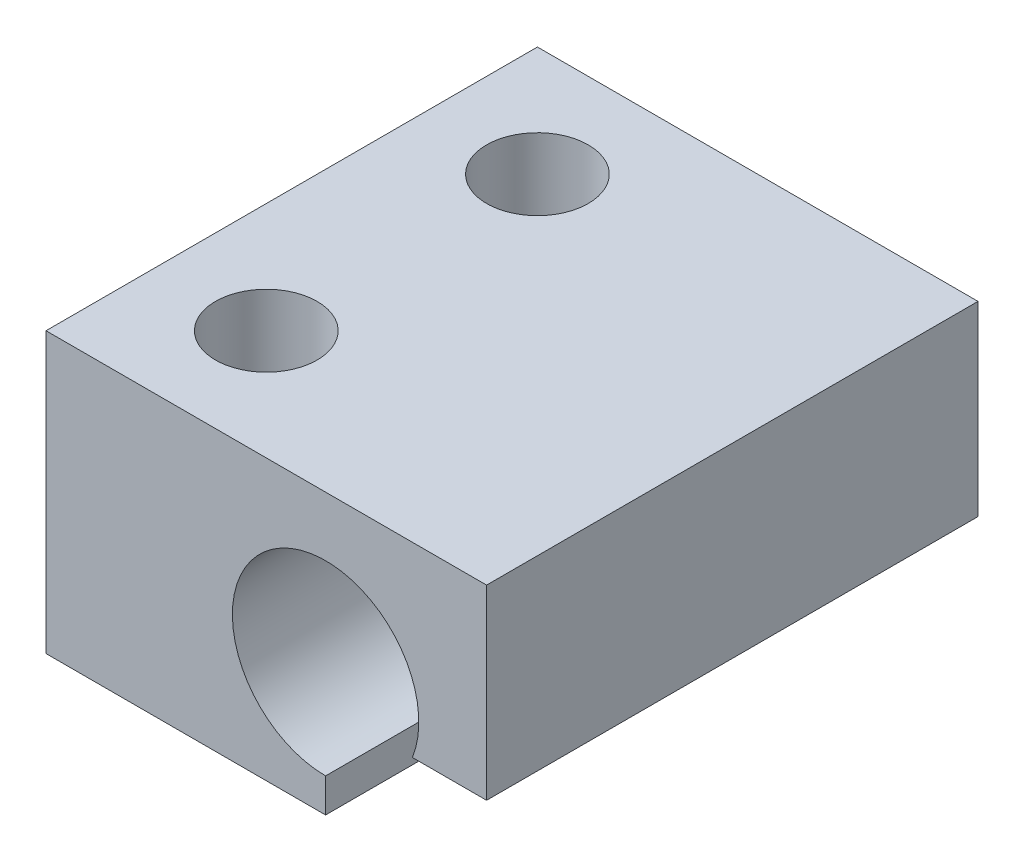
ISO-10303-21;
HEADER;
FILE_DESCRIPTION(('STEP AP214'),'2;1');
FILE_NAME('part.step','',(''),(''),'','','');
FILE_SCHEMA(('AUTOMOTIVE_DESIGN { 1 0 10303 214 1 1 1 1 }'));
ENDSEC;
DATA;
#1=APPLICATION_CONTEXT('core data for automotive mechanical design processes');
#2=APPLICATION_PROTOCOL_DEFINITION('international standard','automotive_design',2000,#1);
#3=PRODUCT_CONTEXT('',#1,'mechanical');
#4=PRODUCT('Part','Part','',(#3));
#5=PRODUCT_RELATED_PRODUCT_CATEGORY('part','',(#4));
#6=PRODUCT_DEFINITION_FORMATION('','',#4);
#7=PRODUCT_DEFINITION_CONTEXT('part definition',#1,'design');
#8=PRODUCT_DEFINITION('design','',#6,#7);
#9=PRODUCT_DEFINITION_SHAPE('','',#8);
#10=(LENGTH_UNIT() NAMED_UNIT(*) SI_UNIT(.MILLI.,.METRE.));
#11=(NAMED_UNIT(*) PLANE_ANGLE_UNIT() SI_UNIT($,.RADIAN.));
#12=(NAMED_UNIT(*) SI_UNIT($,.STERADIAN.) SOLID_ANGLE_UNIT());
#13=UNCERTAINTY_MEASURE_WITH_UNIT(LENGTH_MEASURE(1.E-05),#10,'distance_accuracy_value','');
#14=(GEOMETRIC_REPRESENTATION_CONTEXT(3) GLOBAL_UNCERTAINTY_ASSIGNED_CONTEXT((#13)) GLOBAL_UNIT_ASSIGNED_CONTEXT((#10,
#11,#12)) REPRESENTATION_CONTEXT('',''));
#15=CARTESIAN_POINT('',(0.,0.,0.));
#16=DIRECTION('',(0.,0.,1.));
#17=DIRECTION('',(1.,0.,0.));
#18=AXIS2_PLACEMENT_3D('',#15,#16,#17);
#19=CARTESIAN_POINT('',(-13.,8.25,29.));
#20=DIRECTION('',(1.,0.,0.));
#21=DIRECTION('',(0.,0.,-1.));
#22=AXIS2_PLACEMENT_3D('',#19,#20,#21);
#23=PLANE('',#22);
#24=DIRECTION('',(0.,-1.,0.));
#25=VECTOR('',#24,1.);
#26=CARTESIAN_POINT('',(-13.,8.25,0.));
#27=LINE('',#26,#25);
#28=CARTESIAN_POINT('',(-13.,8.25,0.));
#29=VERTEX_POINT('',#28);
#30=CARTESIAN_POINT('',(-13.,-8.25,0.));
#31=VERTEX_POINT('',#30);
#32=EDGE_CURVE('E120',#29,#31,#27,.T.);
#33=ORIENTED_EDGE('',*,*,#32,.T.);
#34=DIRECTION('',(0.,0.,-1.));
#35=VECTOR('',#34,1.);
#36=CARTESIAN_POINT('',(-13.,-8.25,29.));
#37=LINE('',#36,#35);
#38=CARTESIAN_POINT('',(-13.,-8.25,29.));
#39=VERTEX_POINT('',#38);
#40=EDGE_CURVE('E11',#39,#31,#37,.T.);
#41=ORIENTED_EDGE('',*,*,#40,.F.);
#42=DIRECTION('',(0.,-1.,0.));
#43=VECTOR('',#42,1.);
#44=CARTESIAN_POINT('',(-13.,8.25,29.));
#45=LINE('',#44,#43);
#46=CARTESIAN_POINT('',(-13.,8.25,29.));
#47=VERTEX_POINT('',#46);
#48=EDGE_CURVE('E133',#47,#39,#45,.T.);
#49=ORIENTED_EDGE('',*,*,#48,.F.);
#50=DIRECTION('',(0.,0.,-1.));
#51=VECTOR('',#50,1.);
#52=CARTESIAN_POINT('',(-13.,8.25,29.));
#53=LINE('',#52,#51);
#54=EDGE_CURVE('E116',#47,#29,#53,.T.);
#55=ORIENTED_EDGE('',*,*,#54,.T.);
#56=EDGE_LOOP('',(#33,#41,#49,#55));
#57=FACE_BOUND('',#56,.T.);
#58=ADVANCED_FACE('F30',(#57),#23,.F.);
#59=CARTESIAN_POINT('',(-13.,-8.25,29.));
#60=DIRECTION('',(0.,1.,0.));
#61=DIRECTION('',(0.,0.,1.));
#62=AXIS2_PLACEMENT_3D('',#59,#60,#61);
#63=PLANE('',#62);
#64=CARTESIAN_POINT('',(-6.5,-8.25,22.5));
#65=DIRECTION('',(0.,-1.,0.));
#66=DIRECTION('',(0.,0.,-1.));
#67=AXIS2_PLACEMENT_3D('',#64,#65,#66);
#68=CIRCLE('',#67,4.75);
#69=CARTESIAN_POINT('',(-6.5,-8.25,17.75));
#70=VERTEX_POINT('',#69);
#71=EDGE_CURVE('E176',#70,#70,#68,.T.);
#72=ORIENTED_EDGE('',*,*,#71,.F.);
#73=EDGE_LOOP('',(#72));
#74=FACE_BOUND('',#73,.T.);
#75=CARTESIAN_POINT('',(-6.5,-8.25,6.5));
#76=DIRECTION('',(0.,-1.,0.));
#77=DIRECTION('',(0.,0.,-1.));
#78=AXIS2_PLACEMENT_3D('',#75,#76,#77);
#79=CIRCLE('',#78,4.75);
#80=CARTESIAN_POINT('',(-6.5,-8.25,1.75));
#81=VERTEX_POINT('',#80);
#82=EDGE_CURVE('E164',#81,#81,#79,.T.);
#83=ORIENTED_EDGE('',*,*,#82,.F.);
#84=EDGE_LOOP('',(#83));
#85=FACE_BOUND('',#84,.T.);
#86=DIRECTION('',(1.,0.,0.));
#87=VECTOR('',#86,1.);
#88=CARTESIAN_POINT('',(-13.,-8.25,0.));
#89=LINE('',#88,#87);
#90=CARTESIAN_POINT('',(3.5,-8.25,0.));
#91=VERTEX_POINT('',#90);
#92=EDGE_CURVE('E123',#31,#91,#89,.T.);
#93=ORIENTED_EDGE('',*,*,#92,.T.);
#94=DIRECTION('',(0.,0.,-1.));
#95=VECTOR('',#94,1.);
#96=CARTESIAN_POINT('',(3.5,-8.25,29.));
#97=LINE('',#96,#95);
#98=CARTESIAN_POINT('',(3.5,-8.25,29.));
#99=VERTEX_POINT('',#98);
#100=EDGE_CURVE('E38',#99,#91,#97,.T.);
#101=ORIENTED_EDGE('',*,*,#100,.F.);
#102=DIRECTION('',(1.,0.,0.));
#103=VECTOR('',#102,1.);
#104=CARTESIAN_POINT('',(-13.,-8.25,29.));
#105=LINE('',#104,#103);
#106=EDGE_CURVE('E86',#39,#99,#105,.T.);
#107=ORIENTED_EDGE('',*,*,#106,.F.);
#108=ORIENTED_EDGE('',*,*,#40,.T.);
#109=EDGE_LOOP('',(#93,#101,#107,#108));
#110=FACE_BOUND('',#109,.T.);
#111=ADVANCED_FACE('F182',(#74,#85,#110),#63,.F.);
#112=CARTESIAN_POINT('',(3.5,-6.25,29.));
#113=DIRECTION('',(-1.,0.,0.));
#114=DIRECTION('',(0.,-1.,0.));
#115=AXIS2_PLACEMENT_3D('',#112,#113,#114);
#116=PLANE('',#115);
#117=DIRECTION('',(0.,1.,0.));
#118=VECTOR('',#117,1.);
#119=CARTESIAN_POINT('',(3.5,-6.25,0.));
#120=LINE('',#119,#118);
#121=CARTESIAN_POINT('',(3.5,-6.25,0.));
#122=VERTEX_POINT('',#121);
#123=EDGE_CURVE('E126',#91,#122,#120,.T.);
#124=ORIENTED_EDGE('',*,*,#123,.T.);
#125=DIRECTION('',(0.,0.,-1.));
#126=VECTOR('',#125,1.);
#127=CARTESIAN_POINT('',(3.5,-6.25,29.));
#128=LINE('',#127,#126);
#129=CARTESIAN_POINT('',(3.5,-6.25,29.));
#130=VERTEX_POINT('',#129);
#131=EDGE_CURVE('E137',#130,#122,#128,.T.);
#132=ORIENTED_EDGE('',*,*,#131,.F.);
#133=DIRECTION('',(0.,1.,0.));
#134=VECTOR('',#133,1.);
#135=CARTESIAN_POINT('',(3.5,-6.25,29.));
#136=LINE('',#135,#134);
#137=EDGE_CURVE('E145',#99,#130,#136,.T.);
#138=ORIENTED_EDGE('',*,*,#137,.F.);
#139=ORIENTED_EDGE('',*,*,#100,.T.);
#140=EDGE_LOOP('',(#124,#132,#138,#139));
#141=FACE_BOUND('',#140,.T.);
#142=ADVANCED_FACE('F143',(#141),#116,.F.);
#143=CARTESIAN_POINT('',(3.5,-0.75,29.));
#144=DIRECTION('',(0.,0.,-1.));
#145=DIRECTION('',(-1.,0.,0.));
#146=AXIS2_PLACEMENT_3D('',#143,#144,#145);
#147=CYLINDRICAL_SURFACE('',#146,5.5);
#148=CARTESIAN_POINT('',(3.5,-0.75,0.));
#149=DIRECTION('',(0.,0.,-1.));
#150=DIRECTION('',(-1.,0.,0.));
#151=AXIS2_PLACEMENT_3D('',#148,#149,#150);
#152=CIRCLE('',#151,5.5);
#153=CARTESIAN_POINT('',(8.6234753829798,-2.75,0.));
#154=VERTEX_POINT('',#153);
#155=EDGE_CURVE('E128',#122,#154,#152,.T.);
#156=ORIENTED_EDGE('',*,*,#155,.T.);
#157=DIRECTION('',(0.,0.,-1.));
#158=VECTOR('',#157,1.);
#159=CARTESIAN_POINT('',(8.6234753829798,-2.75,29.));
#160=LINE('',#159,#158);
#161=CARTESIAN_POINT('',(8.6234753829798,-2.75,29.));
#162=VERTEX_POINT('',#161);
#163=EDGE_CURVE('E111',#162,#154,#160,.T.);
#164=ORIENTED_EDGE('',*,*,#163,.F.);
#165=CARTESIAN_POINT('',(3.5,-0.75,29.));
#166=DIRECTION('',(0.,0.,-1.));
#167=DIRECTION('',(-1.,0.,0.));
#168=AXIS2_PLACEMENT_3D('',#165,#166,#167);
#169=CIRCLE('',#168,5.5);
#170=EDGE_CURVE('E102',#130,#162,#169,.T.);
#171=ORIENTED_EDGE('',*,*,#170,.F.);
#172=ORIENTED_EDGE('',*,*,#131,.T.);
#173=EDGE_LOOP('',(#156,#164,#171,#172));
#174=FACE_BOUND('',#173,.T.);
#175=ADVANCED_FACE('F151',(#174),#147,.F.);
#176=CARTESIAN_POINT('',(13.,-2.75,29.));
#177=DIRECTION('',(0.,1.,0.));
#178=DIRECTION('',(0.,0.,1.));
#179=AXIS2_PLACEMENT_3D('',#176,#177,#178);
#180=PLANE('',#179);
#181=DIRECTION('',(1.,0.,0.));
#182=VECTOR('',#181,1.);
#183=CARTESIAN_POINT('',(13.,-2.75,0.));
#184=LINE('',#183,#182);
#185=CARTESIAN_POINT('',(13.,-2.75,0.));
#186=VERTEX_POINT('',#185);
#187=EDGE_CURVE('E110',#154,#186,#184,.T.);
#188=ORIENTED_EDGE('',*,*,#187,.T.);
#189=DIRECTION('',(0.,0.,-1.));
#190=VECTOR('',#189,1.);
#191=CARTESIAN_POINT('',(13.,-2.75,29.));
#192=LINE('',#191,#190);
#193=CARTESIAN_POINT('',(13.,-2.75,29.));
#194=VERTEX_POINT('',#193);
#195=EDGE_CURVE('E107',#194,#186,#192,.T.);
#196=ORIENTED_EDGE('',*,*,#195,.F.);
#197=DIRECTION('',(1.,0.,0.));
#198=VECTOR('',#197,1.);
#199=CARTESIAN_POINT('',(13.,-2.75,29.));
#200=LINE('',#199,#198);
#201=EDGE_CURVE('E96',#162,#194,#200,.T.);
#202=ORIENTED_EDGE('',*,*,#201,.F.);
#203=ORIENTED_EDGE('',*,*,#163,.T.);
#204=EDGE_LOOP('',(#188,#196,#202,#203));
#205=FACE_BOUND('',#204,.T.);
#206=ADVANCED_FACE('F108',(#205),#180,.F.);
#207=CARTESIAN_POINT('',(13.,8.25,29.));
#208=DIRECTION('',(-1.,0.,0.));
#209=DIRECTION('',(0.,0.,1.));
#210=AXIS2_PLACEMENT_3D('',#207,#208,#209);
#211=PLANE('',#210);
#212=DIRECTION('',(0.,1.,0.));
#213=VECTOR('',#212,1.);
#214=CARTESIAN_POINT('',(13.,8.25,0.));
#215=LINE('',#214,#213);
#216=CARTESIAN_POINT('',(13.,8.25,0.));
#217=VERTEX_POINT('',#216);
#218=EDGE_CURVE('E72',#186,#217,#215,.T.);
#219=ORIENTED_EDGE('',*,*,#218,.T.);
#220=DIRECTION('',(0.,0.,-1.));
#221=VECTOR('',#220,1.);
#222=CARTESIAN_POINT('',(13.,8.25,29.));
#223=LINE('',#222,#221);
#224=CARTESIAN_POINT('',(13.,8.25,29.));
#225=VERTEX_POINT('',#224);
#226=EDGE_CURVE('E112',#225,#217,#223,.T.);
#227=ORIENTED_EDGE('',*,*,#226,.F.);
#228=DIRECTION('',(0.,1.,0.));
#229=VECTOR('',#228,1.);
#230=CARTESIAN_POINT('',(13.,8.25,29.));
#231=LINE('',#230,#229);
#232=EDGE_CURVE('E100',#194,#225,#231,.T.);
#233=ORIENTED_EDGE('',*,*,#232,.F.);
#234=ORIENTED_EDGE('',*,*,#195,.T.);
#235=EDGE_LOOP('',(#219,#227,#233,#234));
#236=FACE_BOUND('',#235,.T.);
#237=ADVANCED_FACE('F114',(#236),#211,.F.);
#238=CARTESIAN_POINT('',(-13.,8.25,29.));
#239=DIRECTION('',(0.,-1.,0.));
#240=DIRECTION('',(0.,0.,-1.));
#241=AXIS2_PLACEMENT_3D('',#238,#239,#240);
#242=PLANE('',#241);
#243=CARTESIAN_POINT('',(-6.5,8.25,22.5));
#244=DIRECTION('',(0.,-1.,0.));
#245=DIRECTION('',(0.,0.,-1.));
#246=AXIS2_PLACEMENT_3D('',#243,#244,#245);
#247=CIRCLE('',#246,3.);
#248=CARTESIAN_POINT('',(-6.5,8.25,19.5));
#249=VERTEX_POINT('',#248);
#250=EDGE_CURVE('E167',#249,#249,#247,.T.);
#251=ORIENTED_EDGE('',*,*,#250,.T.);
#252=EDGE_LOOP('',(#251));
#253=FACE_BOUND('',#252,.T.);
#254=CARTESIAN_POINT('',(-6.5,8.25,6.5));
#255=DIRECTION('',(0.,-1.,0.));
#256=DIRECTION('',(0.,0.,-1.));
#257=AXIS2_PLACEMENT_3D('',#254,#255,#256);
#258=CIRCLE('',#257,3.);
#259=CARTESIAN_POINT('',(-6.5,8.25,3.5));
#260=VERTEX_POINT('',#259);
#261=EDGE_CURVE('E124',#260,#260,#258,.T.);
#262=ORIENTED_EDGE('',*,*,#261,.T.);
#263=EDGE_LOOP('',(#262));
#264=FACE_BOUND('',#263,.T.);
#265=DIRECTION('',(-1.,0.,0.));
#266=VECTOR('',#265,1.);
#267=CARTESIAN_POINT('',(-13.,8.25,0.));
#268=LINE('',#267,#266);
#269=EDGE_CURVE('E78',#217,#29,#268,.T.);
#270=ORIENTED_EDGE('',*,*,#269,.T.);
#271=ORIENTED_EDGE('',*,*,#54,.F.);
#272=DIRECTION('',(-1.,0.,0.));
#273=VECTOR('',#272,1.);
#274=CARTESIAN_POINT('',(-13.,8.25,29.));
#275=LINE('',#274,#273);
#276=EDGE_CURVE('E46',#225,#47,#275,.T.);
#277=ORIENTED_EDGE('',*,*,#276,.F.);
#278=ORIENTED_EDGE('',*,*,#226,.T.);
#279=EDGE_LOOP('',(#270,#271,#277,#278));
#280=FACE_BOUND('',#279,.T.);
#281=ADVANCED_FACE('F189',(#253,#264,#280),#242,.F.);
#282=CARTESIAN_POINT('',(3.5,-0.75,29.));
#283=DIRECTION('',(0.,0.,-1.));
#284=DIRECTION('',(-1.,0.,0.));
#285=AXIS2_PLACEMENT_3D('',#282,#283,#284);
#286=PLANE('',#285);
#287=ORIENTED_EDGE('',*,*,#48,.T.);
#288=ORIENTED_EDGE('',*,*,#106,.T.);
#289=ORIENTED_EDGE('',*,*,#137,.T.);
#290=ORIENTED_EDGE('',*,*,#170,.T.);
#291=ORIENTED_EDGE('',*,*,#201,.T.);
#292=ORIENTED_EDGE('',*,*,#232,.T.);
#293=ORIENTED_EDGE('',*,*,#276,.T.);
#294=EDGE_LOOP('',(#287,#288,#289,#290,#291,#292,#293));
#295=FACE_BOUND('',#294,.T.);
#296=ADVANCED_FACE('F98',(#295),#286,.F.);
#297=CARTESIAN_POINT('',(3.5,-0.75,0.));
#298=DIRECTION('',(0.,0.,-1.));
#299=DIRECTION('',(-1.,0.,0.));
#300=AXIS2_PLACEMENT_3D('',#297,#298,#299);
#301=PLANE('',#300);
#302=ORIENTED_EDGE('',*,*,#32,.F.);
#303=ORIENTED_EDGE('',*,*,#269,.F.);
#304=ORIENTED_EDGE('',*,*,#218,.F.);
#305=ORIENTED_EDGE('',*,*,#187,.F.);
#306=ORIENTED_EDGE('',*,*,#155,.F.);
#307=ORIENTED_EDGE('',*,*,#123,.F.);
#308=ORIENTED_EDGE('',*,*,#92,.F.);
#309=EDGE_LOOP('',(#302,#303,#304,#305,#306,#307,#308));
#310=FACE_BOUND('',#309,.T.);
#311=ADVANCED_FACE('F149',(#310),#301,.T.);
#312=CARTESIAN_POINT('',(-6.5,-8.25,6.5));
#313=DIRECTION('',(0.,-1.,0.));
#314=DIRECTION('',(0.,0.,-1.));
#315=AXIS2_PLACEMENT_3D('',#312,#313,#314);
#316=CYLINDRICAL_SURFACE('',#315,3.);
#317=ORIENTED_EDGE('',*,*,#261,.F.);
#318=EDGE_LOOP('',(#317));
#319=FACE_BOUND('',#318,.T.);
#320=CARTESIAN_POINT('',(-6.5,-4.75000000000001,6.5));
#321=DIRECTION('',(0.,-1.,0.));
#322=DIRECTION('',(0.,0.,-1.));
#323=AXIS2_PLACEMENT_3D('',#320,#321,#322);
#324=CIRCLE('',#323,3.);
#325=CARTESIAN_POINT('',(-6.5,-4.75000000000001,3.5));
#326=VERTEX_POINT('',#325);
#327=EDGE_CURVE('E158',#326,#326,#324,.T.);
#328=ORIENTED_EDGE('',*,*,#327,.T.);
#329=EDGE_LOOP('',(#328));
#330=FACE_BOUND('',#329,.T.);
#331=ADVANCED_FACE('F245',(#319,#330),#316,.F.);
#332=CARTESIAN_POINT('',(-3.5,-4.75,6.5));
#333=DIRECTION('',(0.,1.,0.));
#334=DIRECTION('',(0.,0.,1.));
#335=AXIS2_PLACEMENT_3D('',#332,#333,#334);
#336=PLANE('',#335);
#337=ORIENTED_EDGE('',*,*,#327,.F.);
#338=EDGE_LOOP('',(#337));
#339=FACE_BOUND('',#338,.T.);
#340=CARTESIAN_POINT('',(-6.5,-4.75,6.5));
#341=DIRECTION('',(0.,-1.,0.));
#342=DIRECTION('',(0.,0.,-1.));
#343=AXIS2_PLACEMENT_3D('',#340,#341,#342);
#344=CIRCLE('',#343,4.75);
#345=CARTESIAN_POINT('',(-6.5,-4.75,1.75));
#346=VERTEX_POINT('',#345);
#347=EDGE_CURVE('E161',#346,#346,#344,.T.);
#348=ORIENTED_EDGE('',*,*,#347,.T.);
#349=EDGE_LOOP('',(#348));
#350=FACE_BOUND('',#349,.T.);
#351=ADVANCED_FACE('F254',(#339,#350),#336,.F.);
#352=CARTESIAN_POINT('',(-6.5,-8.25,6.5));
#353=DIRECTION('',(0.,-1.,0.));
#354=DIRECTION('',(0.,0.,-1.));
#355=AXIS2_PLACEMENT_3D('',#352,#353,#354);
#356=CYLINDRICAL_SURFACE('',#355,4.75);
#357=ORIENTED_EDGE('',*,*,#347,.F.);
#358=EDGE_LOOP('',(#357));
#359=FACE_BOUND('',#358,.T.);
#360=ORIENTED_EDGE('',*,*,#82,.T.);
#361=EDGE_LOOP('',(#360));
#362=FACE_BOUND('',#361,.T.);
#363=ADVANCED_FACE('F261',(#359,#362),#356,.F.);
#364=CARTESIAN_POINT('',(-6.5,-8.25,22.5));
#365=DIRECTION('',(0.,-1.,0.));
#366=DIRECTION('',(0.,0.,-1.));
#367=AXIS2_PLACEMENT_3D('',#364,#365,#366);
#368=CYLINDRICAL_SURFACE('',#367,3.);
#369=ORIENTED_EDGE('',*,*,#250,.F.);
#370=EDGE_LOOP('',(#369));
#371=FACE_BOUND('',#370,.T.);
#372=CARTESIAN_POINT('',(-6.5,-4.75000000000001,22.5));
#373=DIRECTION('',(0.,-1.,0.));
#374=DIRECTION('',(0.,0.,-1.));
#375=AXIS2_PLACEMENT_3D('',#372,#373,#374);
#376=CIRCLE('',#375,3.);
#377=CARTESIAN_POINT('',(-6.5,-4.75000000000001,19.5));
#378=VERTEX_POINT('',#377);
#379=EDGE_CURVE('E170',#378,#378,#376,.T.);
#380=ORIENTED_EDGE('',*,*,#379,.T.);
#381=EDGE_LOOP('',(#380));
#382=FACE_BOUND('',#381,.T.);
#383=ADVANCED_FACE('F269',(#371,#382),#368,.F.);
#384=CARTESIAN_POINT('',(-3.5,-4.75,22.5));
#385=DIRECTION('',(0.,1.,0.));
#386=DIRECTION('',(0.,0.,1.));
#387=AXIS2_PLACEMENT_3D('',#384,#385,#386);
#388=PLANE('',#387);
#389=ORIENTED_EDGE('',*,*,#379,.F.);
#390=EDGE_LOOP('',(#389));
#391=FACE_BOUND('',#390,.T.);
#392=CARTESIAN_POINT('',(-6.5,-4.75,22.5));
#393=DIRECTION('',(0.,-1.,0.));
#394=DIRECTION('',(0.,0.,-1.));
#395=AXIS2_PLACEMENT_3D('',#392,#393,#394);
#396=CIRCLE('',#395,4.75);
#397=CARTESIAN_POINT('',(-6.5,-4.75,17.75));
#398=VERTEX_POINT('',#397);
#399=EDGE_CURVE('E173',#398,#398,#396,.T.);
#400=ORIENTED_EDGE('',*,*,#399,.T.);
#401=EDGE_LOOP('',(#400));
#402=FACE_BOUND('',#401,.T.);
#403=ADVANCED_FACE('F277',(#391,#402),#388,.F.);
#404=CARTESIAN_POINT('',(-6.5,-8.25,22.5));
#405=DIRECTION('',(0.,-1.,0.));
#406=DIRECTION('',(0.,0.,-1.));
#407=AXIS2_PLACEMENT_3D('',#404,#405,#406);
#408=CYLINDRICAL_SURFACE('',#407,4.75);
#409=ORIENTED_EDGE('',*,*,#399,.F.);
#410=EDGE_LOOP('',(#409));
#411=FACE_BOUND('',#410,.T.);
#412=ORIENTED_EDGE('',*,*,#71,.T.);
#413=EDGE_LOOP('',(#412));
#414=FACE_BOUND('',#413,.T.);
#415=ADVANCED_FACE('F180',(#411,#414),#408,.F.);
#416=CLOSED_SHELL('',(#58,#111,#142,#175,#206,#237,#281,#296,#311,#331,#351,#363,#383,#403,#415));
#417=MANIFOLD_SOLID_BREP('B2',#416);
#418=ADVANCED_BREP_SHAPE_REPRESENTATION('',(#18,#417),#14);
#419=SHAPE_DEFINITION_REPRESENTATION(#9,#418);
ENDSEC;
END-ISO-10303-21;
